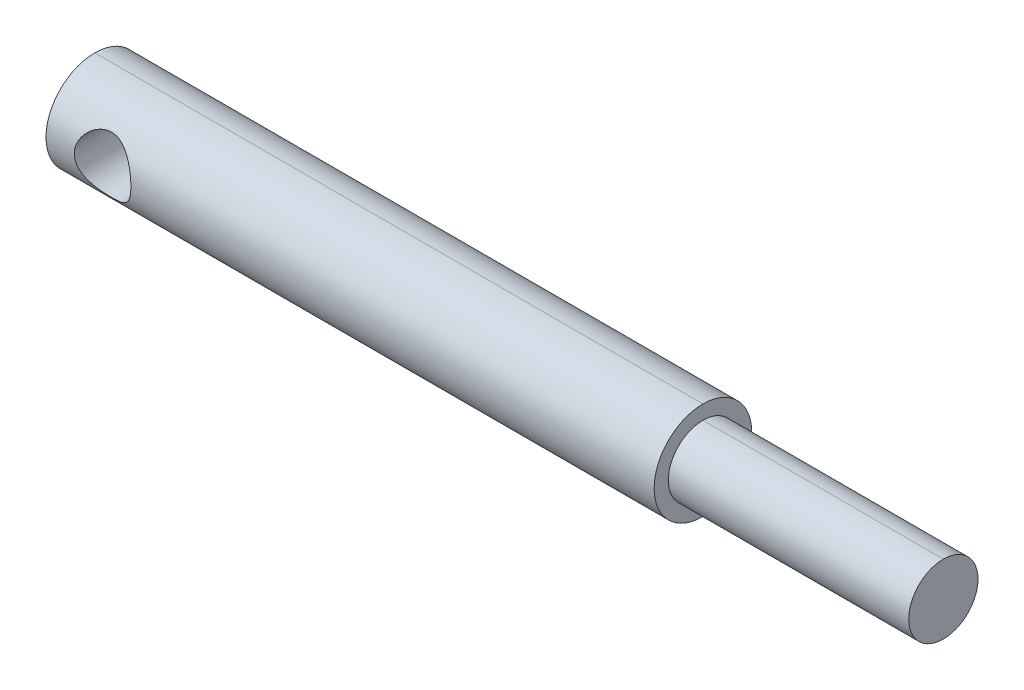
ISO-10303-21;
HEADER;
FILE_DESCRIPTION(('STEP AP214'),'2;1');
FILE_NAME('part.step','',(''),(''),'','','');
FILE_SCHEMA(('AUTOMOTIVE_DESIGN { 1 0 10303 214 1 1 1 1 }'));
ENDSEC;
DATA;
#1=APPLICATION_CONTEXT('core data for automotive mechanical design processes');
#2=APPLICATION_PROTOCOL_DEFINITION('international standard','automotive_design',2000,#1);
#3=PRODUCT_CONTEXT('',#1,'mechanical');
#4=PRODUCT('Part','Part','',(#3));
#5=PRODUCT_RELATED_PRODUCT_CATEGORY('part','',(#4));
#6=PRODUCT_DEFINITION_FORMATION('','',#4);
#7=PRODUCT_DEFINITION_CONTEXT('part definition',#1,'design');
#8=PRODUCT_DEFINITION('design','',#6,#7);
#9=PRODUCT_DEFINITION_SHAPE('','',#8);
#10=(LENGTH_UNIT() NAMED_UNIT(*) SI_UNIT(.MILLI.,.METRE.));
#11=(NAMED_UNIT(*) PLANE_ANGLE_UNIT() SI_UNIT($,.RADIAN.));
#12=(NAMED_UNIT(*) SI_UNIT($,.STERADIAN.) SOLID_ANGLE_UNIT());
#13=UNCERTAINTY_MEASURE_WITH_UNIT(LENGTH_MEASURE(1.E-05),#10,'distance_accuracy_value','');
#14=(GEOMETRIC_REPRESENTATION_CONTEXT(3) GLOBAL_UNCERTAINTY_ASSIGNED_CONTEXT((#13)) GLOBAL_UNIT_ASSIGNED_CONTEXT((#10,
#11,#12)) REPRESENTATION_CONTEXT('',''));
#15=CARTESIAN_POINT('',(0.,0.,0.));
#16=DIRECTION('',(0.,0.,1.));
#17=DIRECTION('',(1.,0.,0.));
#18=AXIS2_PLACEMENT_3D('',#15,#16,#17);
#19=CARTESIAN_POINT('',(-246.,48.0172,-6.9828));
#20=DIRECTION('',(1.,0.,0.));
#21=DIRECTION('',(0.,1.,0.));
#22=AXIS2_PLACEMENT_3D('',#19,#20,#21);
#23=PLANE('',#22);
#24=CARTESIAN_POINT('',(-246.,55.,0.));
#25=DIRECTION('',(1.,0.,0.));
#26=DIRECTION('',(0.,0.,-1.));
#27=AXIS2_PLACEMENT_3D('',#24,#25,#26);
#28=CIRCLE('',#27,6.9);
#29=CARTESIAN_POINT('',(-246.,61.9,-6.19576247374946E-10));
#30=VERTEX_POINT('',#29);
#31=CARTESIAN_POINT('',(-246.,48.1,-2.83042710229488E-09));
#32=VERTEX_POINT('',#31);
#33=EDGE_CURVE('E74',#30,#32,#28,.F.);
#34=ORIENTED_EDGE('',*,*,#33,.T.);
#35=CARTESIAN_POINT('',(-246.,55.,0.));
#36=DIRECTION('',(1.,0.,0.));
#37=DIRECTION('',(0.,0.,-1.));
#38=AXIS2_PLACEMENT_3D('',#35,#36,#37);
#39=CIRCLE('',#38,6.9);
#40=EDGE_CURVE('E78',#32,#30,#39,.F.);
#41=ORIENTED_EDGE('',*,*,#40,.T.);
#42=EDGE_LOOP('',(#34,#41));
#43=FACE_BOUND('',#42,.T.);
#44=ADVANCED_FACE('F32',(#43),#23,.F.);
#45=CARTESIAN_POINT('',(-246.,55.,0.));
#46=DIRECTION('',(1.,0.,0.));
#47=DIRECTION('',(0.,0.,-1.));
#48=AXIS2_PLACEMENT_3D('',#45,#46,#47);
#49=CYLINDRICAL_SURFACE('',#48,6.9);
#50=CARTESIAN_POINT('',(-234.,55.,-6.90000000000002));
#51=CARTESIAN_POINT('',(-234.000000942,55.1029536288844,-6.89999914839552));
#52=CARTESIAN_POINT('',(-234.003981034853,55.2059322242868,-6.89768975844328));
#53=CARTESIAN_POINT('',(-234.019851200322,55.4111154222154,-6.88850812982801));
#54=CARTESIAN_POINT('',(-234.031745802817,55.5133195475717,-6.88163327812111));
#55=CARTESIAN_POINT('',(-234.063319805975,55.716319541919,-6.8634744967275));
#56=CARTESIAN_POINT('',(-234.083013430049,55.8171124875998,-6.85218251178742));
#57=CARTESIAN_POINT('',(-234.129928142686,56.0163871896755,-6.82547368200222));
#58=CARTESIAN_POINT('',(-234.157152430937,56.1148679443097,-6.81005508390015));
#59=CARTESIAN_POINT('',(-234.249351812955,56.4048279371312,-6.75830854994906));
#60=CARTESIAN_POINT('',(-234.325045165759,56.5920284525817,-6.71637576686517));
#61=CARTESIAN_POINT('',(-234.502031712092,56.9504528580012,-6.6211962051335));
#62=CARTESIAN_POINT('',(-234.603319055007,57.1216803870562,-6.56795201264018));
#63=CARTESIAN_POINT('',(-234.836966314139,57.4576592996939,-6.45010475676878));
#64=CARTESIAN_POINT('',(-234.971062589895,57.6210102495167,-6.38495451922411));
#65=CARTESIAN_POINT('',(-235.262658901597,57.9242609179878,-6.25189508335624));
#66=CARTESIAN_POINT('',(-235.420186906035,58.0641321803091,-6.18398265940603));
#67=CARTESIAN_POINT('',(-235.775139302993,58.3324040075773,-6.04404159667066));
#68=CARTESIAN_POINT('',(-235.975058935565,58.4577379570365,-5.97241093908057));
#69=CARTESIAN_POINT('',(-236.397316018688,58.6725030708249,-5.84281917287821));
#70=CARTESIAN_POINT('',(-236.619618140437,58.7619897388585,-5.7848369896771));
#71=CARTESIAN_POINT('',(-237.028696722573,58.8847457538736,-5.70288612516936));
#72=CARTESIAN_POINT('',(-237.212076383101,58.9261667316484,-5.67418342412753));
#73=CARTESIAN_POINT('',(-237.584643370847,58.9828228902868,-5.63456907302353));
#74=CARTESIAN_POINT('',(-237.773823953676,58.9980873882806,-5.62363750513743));
#75=CARTESIAN_POINT('',(-238.152849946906,59.0015765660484,-5.62115580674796));
#76=CARTESIAN_POINT('',(-238.342695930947,58.9897600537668,-5.6296352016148));
#77=CARTESIAN_POINT('',(-238.717187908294,58.9397195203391,-5.66475958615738));
#78=CARTESIAN_POINT('',(-238.901830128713,58.901476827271,-5.69141741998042));
#79=CARTESIAN_POINT('',(-239.260211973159,58.800832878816,-5.75910335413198));
#80=CARTESIAN_POINT('',(-239.434012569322,58.7385842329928,-5.80004052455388));
#81=CARTESIAN_POINT('',(-239.769220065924,58.5921251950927,-5.89186690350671));
#82=CARTESIAN_POINT('',(-239.930622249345,58.5079064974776,-5.94275987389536));
#83=CARTESIAN_POINT('',(-240.264658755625,58.3038846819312,-6.05889860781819));
#84=CARTESIAN_POINT('',(-240.434771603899,58.1805066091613,-6.12512813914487));
#85=CARTESIAN_POINT('',(-240.753530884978,57.9089529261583,-6.25867106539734));
#86=CARTESIAN_POINT('',(-240.902158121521,57.7607553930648,-6.32598537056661));
#87=CARTESIAN_POINT('',(-241.191932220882,57.4221660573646,-6.46376529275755));
#88=CARTESIAN_POINT('',(-241.330003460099,57.2288393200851,-6.53362834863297));
#89=CARTESIAN_POINT('',(-241.510782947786,56.9205849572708,-6.62819704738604));
#90=CARTESIAN_POINT('',(-241.566672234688,56.8147427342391,-6.65802567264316));
#91=CARTESIAN_POINT('',(-241.669076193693,56.5975797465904,-6.71343854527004));
#92=CARTESIAN_POINT('',(-241.71559658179,56.4862623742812,-6.73902537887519));
#93=CARTESIAN_POINT('',(-241.795848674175,56.2666007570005,-6.78361504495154));
#94=CARTESIAN_POINT('',(-241.830229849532,56.1585596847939,-6.80294484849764));
#95=CARTESIAN_POINT('',(-241.889814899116,55.9392746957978,-6.83666991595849));
#96=CARTESIAN_POINT('',(-241.915023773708,55.8280325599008,-6.85106786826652));
#97=CARTESIAN_POINT('',(-241.955886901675,55.6033182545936,-6.87450078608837));
#98=CARTESIAN_POINT('',(-241.97154702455,55.4898474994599,-6.883539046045));
#99=CARTESIAN_POINT('',(-241.993075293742,55.2616785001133,-6.89598230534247));
#100=CARTESIAN_POINT('',(-241.998944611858,55.146980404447,-6.89938797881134));
#101=CARTESIAN_POINT('',(-242.000679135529,54.9319303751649,-6.90039387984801));
#102=CARTESIAN_POINT('',(-241.997709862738,54.831588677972,-6.89867047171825));
#103=CARTESIAN_POINT('',(-241.984255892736,54.6315475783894,-6.890882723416));
#104=CARTESIAN_POINT('',(-241.973768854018,54.5318483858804,-6.88481703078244));
#105=CARTESIAN_POINT('',(-241.945414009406,54.3338929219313,-6.86849010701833));
#106=CARTESIAN_POINT('',(-241.927549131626,54.2356360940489,-6.85823054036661));
#107=CARTESIAN_POINT('',(-241.884662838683,54.041185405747,-6.83376185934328));
#108=CARTESIAN_POINT('',(-241.859638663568,53.9449923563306,-6.81955122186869));
#109=CARTESIAN_POINT('',(-241.775046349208,53.6632000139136,-6.77191120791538));
#110=CARTESIAN_POINT('',(-241.705513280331,53.4813671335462,-6.73320893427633));
#111=CARTESIAN_POINT('',(-241.542283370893,53.1319761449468,-6.64477881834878));
#112=CARTESIAN_POINT('',(-241.448581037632,52.9644212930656,-6.59504847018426));
#113=CARTESIAN_POINT('',(-241.228669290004,52.6293650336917,-6.48262639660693));
#114=CARTESIAN_POINT('',(-241.100088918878,52.4636914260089,-6.41912382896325));
#115=CARTESIAN_POINT('',(-240.819495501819,52.1549964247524,-6.28841250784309));
#116=CARTESIAN_POINT('',(-240.667455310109,52.0120016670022,-6.22119951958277));
#117=CARTESIAN_POINT('',(-240.323346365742,51.7355990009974,-6.08114935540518));
#118=CARTESIAN_POINT('',(-240.128675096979,51.6052746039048,-6.00857525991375));
#119=CARTESIAN_POINT('',(-239.716470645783,51.3793954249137,-5.8752433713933));
#120=CARTESIAN_POINT('',(-239.498966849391,51.2837966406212,-5.81447067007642));
#121=CARTESIAN_POINT('',(-239.094694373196,51.1481415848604,-5.72523500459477));
#122=CARTESIAN_POINT('',(-238.911369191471,51.1005633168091,-5.69263491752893));
#123=CARTESIAN_POINT('',(-238.537703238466,51.0317693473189,-5.64490496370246));
#124=CARTESIAN_POINT('',(-238.347371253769,51.0105217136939,-5.62975393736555));
#125=CARTESIAN_POINT('',(-237.964584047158,50.9955628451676,-5.61912671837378));
#126=CARTESIAN_POINT('',(-237.772124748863,51.0019195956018,-5.62369910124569));
#127=CARTESIAN_POINT('',(-237.391455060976,51.0419254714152,-5.65192055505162));
#128=CARTESIAN_POINT('',(-237.203247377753,51.0755915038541,-5.6755814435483));
#129=CARTESIAN_POINT('',(-236.84082651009,51.1671941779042,-5.73781556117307));
#130=CARTESIAN_POINT('',(-236.666378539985,51.224488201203,-5.77599200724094));
#131=CARTESIAN_POINT('',(-236.329229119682,51.3610916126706,-5.86301024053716));
#132=CARTESIAN_POINT('',(-236.166531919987,51.4404089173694,-5.91185586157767));
#133=CARTESIAN_POINT('',(-235.830631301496,51.63297076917,-6.02389611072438));
#134=CARTESIAN_POINT('',(-235.65969853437,51.7495661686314,-6.08814150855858));
#135=CARTESIAN_POINT('',(-235.33816570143,52.0071464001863,-6.218822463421));
#136=CARTESIAN_POINT('',(-235.18758437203,52.1481534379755,-6.28525996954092));
#137=CARTESIAN_POINT('',(-234.890171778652,52.4733916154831,-6.42350426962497));
#138=CARTESIAN_POINT('',(-234.746617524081,52.6608911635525,-6.49481761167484));
#139=CARTESIAN_POINT('',(-234.556738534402,52.9608818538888,-6.59265829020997));
#140=CARTESIAN_POINT('',(-234.497672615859,53.0640387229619,-6.62375887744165));
#141=CARTESIAN_POINT('',(-234.38858056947,53.2760970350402,-6.68208171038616));
#142=CARTESIAN_POINT('',(-234.338551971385,53.3849968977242,-6.70930501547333));
#143=CARTESIAN_POINT('',(-234.256251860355,53.5878713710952,-6.75460538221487));
#144=CARTESIAN_POINT('',(-234.222404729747,53.6810407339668,-6.7734476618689));
#145=CARTESIAN_POINT('',(-234.161578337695,53.8702277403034,-6.80755796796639));
#146=CARTESIAN_POINT('',(-234.134597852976,53.9662448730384,-6.82282663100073));
#147=CARTESIAN_POINT('',(-234.08785660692,54.1603129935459,-6.84941585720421));
#148=CARTESIAN_POINT('',(-234.068078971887,54.2583586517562,-6.86074564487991));
#149=CARTESIAN_POINT('',(-234.035900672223,54.45600432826,-6.8792375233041));
#150=CARTESIAN_POINT('',(-234.023496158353,54.5556035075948,-6.8864017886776));
#151=CARTESIAN_POINT('',(-234.009908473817,54.7128235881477,-6.89425964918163));
#152=CARTESIAN_POINT('',(-234.006194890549,54.7701672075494,-6.89641030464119));
#153=CARTESIAN_POINT('',(-234.001240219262,54.885004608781,-6.8992808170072));
#154=CARTESIAN_POINT('',(-233.999999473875,54.942498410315,-6.90000047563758));
#155=CARTESIAN_POINT('',(-234.,55.,-6.90000000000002));
#156=B_SPLINE_CURVE_WITH_KNOTS('',3,(#50,#51,#52,#53,#54,#55,#56,#57,#58,#59,#60,#61,#62,#63,
#64,#65,#66,#67,#68,#69,#70,#71,#72,#73,#74,#75,#76,#77,#78,#79,#80,#81,#82,#83,#84,#85,#86,#87,
#88,#89,#90,#91,#92,#93,#94,#95,#96,#97,#98,#99,#100,#101,#102,#103,#104,#105,#106,#107,#108,
#109,#110,#111,#112,#113,#114,#115,#116,#117,#118,#119,#120,#121,#122,#123,#124,#125,#126,#127,
#128,#129,#130,#131,#132,#133,#134,#135,#136,#137,#138,#139,#140,#141,#142,#143,#144,#145,#146,
#147,#148,#149,#150,#151,#152,#153,#154,#155),.UNSPECIFIED.,.T.,.F.,(4,2,2,2,2,2,2,2,2,2,2,2,2,
2,2,2,2,2,2,2,2,2,2,2,2,2,2,2,2,2,2,2,2,2,2,2,2,2,2,2,2,2,2,2,2,2,2,2,2,2,2,2,4),(0.,
0.308801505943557,0.617779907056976,0.927324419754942,1.23700065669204,1.85272790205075,
2.4683145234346,3.12913553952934,3.79075174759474,4.52689089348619,5.26188580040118,
5.82996811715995,6.39741328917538,6.96572215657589,7.53443298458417,8.09958649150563,
8.66495395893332,9.32334568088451,9.98232205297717,10.7209503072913,11.0905649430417,
11.4599533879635,11.804510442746,12.1488793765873,12.4930364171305,12.83715226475,
13.1379827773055,13.4389070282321,13.7397119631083,14.0406330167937,14.633393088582,
15.2262879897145,15.8810130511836,16.5365014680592,17.2687489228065,18.000065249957,
18.5741784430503,19.1475947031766,19.7224239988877,20.2976094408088,20.8580872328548,
21.4187667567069,22.0662154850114,22.7142562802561,23.450167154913,23.8183609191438,
24.1864538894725,24.488848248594,24.7911886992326,25.0928162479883,25.3942861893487,
25.5667339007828,25.7392055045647),.UNSPECIFIED.);
#157=CARTESIAN_POINT('',(-234.,55.,-6.90000000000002));
#158=VERTEX_POINT('',#157);
#159=EDGE_CURVE('E81',#158,#158,#156,.T.);
#160=ORIENTED_EDGE('',*,*,#159,.T.);
#161=EDGE_LOOP('',(#160));
#162=FACE_BOUND('',#161,.T.);
#163=ORIENTED_EDGE('',*,*,#33,.F.);
#164=DIRECTION('',(-1.,0.,0.));
#165=VECTOR('',#164,1.);
#166=CARTESIAN_POINT('',(-203.,61.9,0.));
#167=LINE('',#166,#165);
#168=CARTESIAN_POINT('',(-160.,61.9,0.));
#169=VERTEX_POINT('',#168);
#170=EDGE_CURVE('E80',#30,#169,#167,.F.);
#171=ORIENTED_EDGE('',*,*,#170,.T.);
#172=CARTESIAN_POINT('',(-160.,55.,-1.72969529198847E-13));
#173=DIRECTION('',(1.,0.,0.));
#174=DIRECTION('',(0.,0.,-1.));
#175=AXIS2_PLACEMENT_3D('',#172,#173,#174);
#176=CIRCLE('',#175,6.9);
#177=CARTESIAN_POINT('',(-160.,48.1,-2.83042778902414E-09));
#178=VERTEX_POINT('',#177);
#179=EDGE_CURVE('E86',#169,#178,#176,.F.);
#180=ORIENTED_EDGE('',*,*,#179,.T.);
#181=DIRECTION('',(1.,0.,0.));
#182=VECTOR('',#181,1.);
#183=CARTESIAN_POINT('',(-203.,48.1,-2.83042731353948E-09));
#184=LINE('',#183,#182);
#185=EDGE_CURVE('E83',#178,#32,#184,.F.);
#186=ORIENTED_EDGE('',*,*,#185,.T.);
#187=EDGE_LOOP('',(#163,#171,#180,#186));
#188=FACE_BOUND('',#187,.T.);
#189=ADVANCED_FACE('F84',(#162,#188),#49,.T.);
#190=CARTESIAN_POINT('',(-246.,55.,0.));
#191=DIRECTION('',(1.,0.,0.));
#192=DIRECTION('',(0.,0.,-1.));
#193=AXIS2_PLACEMENT_3D('',#190,#191,#192);
#194=CYLINDRICAL_SURFACE('',#193,6.9);
#195=CARTESIAN_POINT('',(-234.,55.,6.89999999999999));
#196=CARTESIAN_POINT('',(-234.000000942,54.8970463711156,6.89999914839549));
#197=CARTESIAN_POINT('',(-234.003981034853,54.7940677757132,6.89768975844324));
#198=CARTESIAN_POINT('',(-234.019851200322,54.5888845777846,6.88850812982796));
#199=CARTESIAN_POINT('',(-234.031745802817,54.4866804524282,6.88163327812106));
#200=CARTESIAN_POINT('',(-234.063319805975,54.283680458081,6.86347449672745));
#201=CARTESIAN_POINT('',(-234.083013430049,54.1828875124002,6.85218251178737));
#202=CARTESIAN_POINT('',(-234.129928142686,53.9836128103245,6.82547368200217));
#203=CARTESIAN_POINT('',(-234.157152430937,53.8851320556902,6.8100550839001));
#204=CARTESIAN_POINT('',(-234.249351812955,53.5951720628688,6.75830854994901));
#205=CARTESIAN_POINT('',(-234.325045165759,53.4079715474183,6.71637576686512));
#206=CARTESIAN_POINT('',(-234.502031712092,53.0495471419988,6.62119620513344));
#207=CARTESIAN_POINT('',(-234.603319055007,52.8783196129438,6.56795201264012));
#208=CARTESIAN_POINT('',(-234.836966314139,52.5423407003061,6.45010475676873));
#209=CARTESIAN_POINT('',(-234.971062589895,52.3789897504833,6.38495451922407));
#210=CARTESIAN_POINT('',(-235.262658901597,52.0757390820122,6.2518950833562));
#211=CARTESIAN_POINT('',(-235.420186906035,51.9358678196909,6.18398265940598));
#212=CARTESIAN_POINT('',(-235.775139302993,51.6675959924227,6.04404159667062));
#213=CARTESIAN_POINT('',(-235.975058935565,51.5422620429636,5.97241093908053));
#214=CARTESIAN_POINT('',(-236.397316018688,51.3274969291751,5.84281917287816));
#215=CARTESIAN_POINT('',(-236.619618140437,51.2380102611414,5.78483698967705));
#216=CARTESIAN_POINT('',(-237.028696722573,51.1152542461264,5.7028861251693));
#217=CARTESIAN_POINT('',(-237.212076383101,51.0738332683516,5.67418342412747));
#218=CARTESIAN_POINT('',(-237.584643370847,51.0171771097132,5.63456907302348));
#219=CARTESIAN_POINT('',(-237.773823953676,51.0019126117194,5.62363750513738));
#220=CARTESIAN_POINT('',(-238.152849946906,50.9984234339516,5.6211558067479));
#221=CARTESIAN_POINT('',(-238.342695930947,51.0102399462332,5.62963520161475));
#222=CARTESIAN_POINT('',(-238.717187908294,51.0602804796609,5.66475958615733));
#223=CARTESIAN_POINT('',(-238.901830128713,51.098523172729,5.69141741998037));
#224=CARTESIAN_POINT('',(-239.260211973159,51.199167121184,5.75910335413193));
#225=CARTESIAN_POINT('',(-239.434012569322,51.2614157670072,5.80004052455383));
#226=CARTESIAN_POINT('',(-239.769220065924,51.4078748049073,5.89186690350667));
#227=CARTESIAN_POINT('',(-239.930622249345,51.4920935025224,5.94275987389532));
#228=CARTESIAN_POINT('',(-240.264658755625,51.6961153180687,6.05889860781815));
#229=CARTESIAN_POINT('',(-240.434771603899,51.8194933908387,6.12512813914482));
#230=CARTESIAN_POINT('',(-240.753530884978,52.0910470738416,6.2586710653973));
#231=CARTESIAN_POINT('',(-240.902158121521,52.2392446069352,6.32598537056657));
#232=CARTESIAN_POINT('',(-241.191932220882,52.5778339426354,6.46376529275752));
#233=CARTESIAN_POINT('',(-241.330003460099,52.7711606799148,6.53362834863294));
#234=CARTESIAN_POINT('',(-241.510782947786,53.0794150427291,6.62819704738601));
#235=CARTESIAN_POINT('',(-241.566672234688,53.1852572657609,6.65802567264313));
#236=CARTESIAN_POINT('',(-241.669076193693,53.4024202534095,6.71343854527));
#237=CARTESIAN_POINT('',(-241.71559658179,53.5137376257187,6.73902537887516));
#238=CARTESIAN_POINT('',(-241.795848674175,53.7333992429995,6.78361504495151));
#239=CARTESIAN_POINT('',(-241.830229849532,53.8414403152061,6.80294484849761));
#240=CARTESIAN_POINT('',(-241.889814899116,54.0607253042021,6.83666991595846));
#241=CARTESIAN_POINT('',(-241.915023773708,54.1719674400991,6.8510678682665));
#242=CARTESIAN_POINT('',(-241.955886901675,54.3966817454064,6.87450078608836));
#243=CARTESIAN_POINT('',(-241.97154702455,54.5101525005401,6.88353904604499));
#244=CARTESIAN_POINT('',(-241.993075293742,54.7383214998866,6.89598230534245));
#245=CARTESIAN_POINT('',(-241.998944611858,54.8530195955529,6.89938797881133));
#246=CARTESIAN_POINT('',(-242.000679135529,55.068069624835,6.900393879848));
#247=CARTESIAN_POINT('',(-241.997709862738,55.168411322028,6.89867047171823));
#248=CARTESIAN_POINT('',(-241.984255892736,55.3684524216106,6.89088272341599));
#249=CARTESIAN_POINT('',(-241.973768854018,55.4681516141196,6.88481703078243));
#250=CARTESIAN_POINT('',(-241.945414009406,55.6661070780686,6.86849010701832));
#251=CARTESIAN_POINT('',(-241.927549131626,55.7643639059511,6.85823054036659));
#252=CARTESIAN_POINT('',(-241.884662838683,55.9588145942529,6.83376185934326));
#253=CARTESIAN_POINT('',(-241.859638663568,56.0550076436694,6.81955122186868));
#254=CARTESIAN_POINT('',(-241.775046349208,56.3367999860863,6.77191120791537));
#255=CARTESIAN_POINT('',(-241.705513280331,56.5186328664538,6.73320893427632));
#256=CARTESIAN_POINT('',(-241.542283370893,56.8680238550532,6.64477881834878));
#257=CARTESIAN_POINT('',(-241.448581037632,57.0355787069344,6.59504847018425));
#258=CARTESIAN_POINT('',(-241.228669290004,57.3706349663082,6.48262639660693));
#259=CARTESIAN_POINT('',(-241.100088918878,57.5363085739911,6.41912382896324));
#260=CARTESIAN_POINT('',(-240.819495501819,57.8450035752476,6.28841250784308));
#261=CARTESIAN_POINT('',(-240.667455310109,57.9879983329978,6.22119951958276));
#262=CARTESIAN_POINT('',(-240.323346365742,58.2644009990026,6.08114935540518));
#263=CARTESIAN_POINT('',(-240.128675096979,58.3947253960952,6.00857525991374));
#264=CARTESIAN_POINT('',(-239.716470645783,58.6206045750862,5.87524337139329));
#265=CARTESIAN_POINT('',(-239.498966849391,58.7162033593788,5.81447067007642));
#266=CARTESIAN_POINT('',(-239.094694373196,58.8518584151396,5.72523500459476));
#267=CARTESIAN_POINT('',(-238.911369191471,58.8994366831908,5.69263491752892));
#268=CARTESIAN_POINT('',(-238.537703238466,58.9682306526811,5.64490496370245));
#269=CARTESIAN_POINT('',(-238.347371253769,58.9894782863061,5.62975393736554));
#270=CARTESIAN_POINT('',(-237.964584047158,59.0044371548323,5.61912671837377));
#271=CARTESIAN_POINT('',(-237.772124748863,58.9980804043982,5.62369910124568));
#272=CARTESIAN_POINT('',(-237.391455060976,58.9580745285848,5.6519205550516));
#273=CARTESIAN_POINT('',(-237.203247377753,58.9244084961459,5.67558144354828));
#274=CARTESIAN_POINT('',(-236.84082651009,58.8328058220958,5.73781556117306));
#275=CARTESIAN_POINT('',(-236.666378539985,58.775511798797,5.77599200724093));
#276=CARTESIAN_POINT('',(-236.329229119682,58.6389083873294,5.86301024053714));
#277=CARTESIAN_POINT('',(-236.166531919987,58.5595910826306,5.91185586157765));
#278=CARTESIAN_POINT('',(-235.830631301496,58.36702923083,6.02389611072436));
#279=CARTESIAN_POINT('',(-235.65969853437,58.2504338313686,6.08814150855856));
#280=CARTESIAN_POINT('',(-235.33816570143,57.9928535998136,6.21882246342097));
#281=CARTESIAN_POINT('',(-235.18758437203,57.8518465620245,6.2852599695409));
#282=CARTESIAN_POINT('',(-234.890171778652,57.5266083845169,6.42350426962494));
#283=CARTESIAN_POINT('',(-234.746617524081,57.3391088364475,6.49481761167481));
#284=CARTESIAN_POINT('',(-234.556738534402,57.0391181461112,6.59265829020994));
#285=CARTESIAN_POINT('',(-234.497672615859,56.935961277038,6.62375887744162));
#286=CARTESIAN_POINT('',(-234.38858056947,56.7239029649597,6.68208171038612));
#287=CARTESIAN_POINT('',(-234.338551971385,56.6150031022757,6.70930501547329));
#288=CARTESIAN_POINT('',(-234.256251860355,56.4121286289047,6.75460538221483));
#289=CARTESIAN_POINT('',(-234.222404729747,56.3189592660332,6.77344766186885));
#290=CARTESIAN_POINT('',(-234.161578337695,56.1297722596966,6.80755796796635));
#291=CARTESIAN_POINT('',(-234.134597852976,56.0337551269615,6.82282663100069));
#292=CARTESIAN_POINT('',(-234.08785660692,55.839687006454,6.84941585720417));
#293=CARTESIAN_POINT('',(-234.068078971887,55.7416413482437,6.86074564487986));
#294=CARTESIAN_POINT('',(-234.035900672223,55.54399567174,6.87923752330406));
#295=CARTESIAN_POINT('',(-234.023496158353,55.4443964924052,6.88640178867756));
#296=CARTESIAN_POINT('',(-234.009908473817,55.2871764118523,6.89425964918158));
#297=CARTESIAN_POINT('',(-234.006194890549,55.2298327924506,6.89641030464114));
#298=CARTESIAN_POINT('',(-234.001240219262,55.114995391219,6.89928081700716));
#299=CARTESIAN_POINT('',(-233.999999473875,55.057501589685,6.90000047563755));
#300=CARTESIAN_POINT('',(-234.,55.,6.89999999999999));
#301=B_SPLINE_CURVE_WITH_KNOTS('',3,(#195,#196,#197,#198,#199,#200,#201,#202,#203,#204,#205,
#206,#207,#208,#209,#210,#211,#212,#213,#214,#215,#216,#217,#218,#219,#220,#221,#222,#223,#224,
#225,#226,#227,#228,#229,#230,#231,#232,#233,#234,#235,#236,#237,#238,#239,#240,#241,#242,#243,
#244,#245,#246,#247,#248,#249,#250,#251,#252,#253,#254,#255,#256,#257,#258,#259,#260,#261,#262,
#263,#264,#265,#266,#267,#268,#269,#270,#271,#272,#273,#274,#275,#276,#277,#278,#279,#280,#281,
#282,#283,#284,#285,#286,#287,#288,#289,#290,#291,#292,#293,#294,#295,#296,#297,#298,#299,#300),
.UNSPECIFIED.,.T.,.F.,(4,2,2,2,2,2,2,2,2,2,2,2,2,2,2,2,2,2,2,2,2,2,2,2,2,2,2,2,2,2,2,2,2,2,2,2,
2,2,2,2,2,2,2,2,2,2,2,2,2,2,2,2,4),(0.,0.308801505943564,0.617779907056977,0.927324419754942,
1.23700065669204,1.85272790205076,2.46831452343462,3.12913553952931,3.79075174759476,
4.52689089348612,5.26188580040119,5.82996811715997,6.3974132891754,6.9657221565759,
7.53443298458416,8.09958649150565,8.66495395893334,9.32334568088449,9.98232205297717,
10.7209503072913,11.0905649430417,11.4599533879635,11.8045104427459,12.1488793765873,
12.4930364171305,12.83715226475,13.1379827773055,13.4389070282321,13.7397119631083,
14.0406330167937,14.633393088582,15.2262879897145,15.8810130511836,16.5365014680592,
17.2687489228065,18.000065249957,18.5741784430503,19.1475947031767,19.7224239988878,
20.2976094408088,20.8580872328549,21.4187667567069,22.0662154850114,22.7142562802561,
23.450167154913,23.8183609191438,24.1864538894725,24.488848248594,24.7911886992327,
25.0928162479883,25.3942861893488,25.5667339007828,25.7392055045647),.UNSPECIFIED.);
#302=CARTESIAN_POINT('',(-234.,55.,6.89999999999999));
#303=VERTEX_POINT('',#302);
#304=EDGE_CURVE('E11',#303,#303,#301,.T.);
#305=ORIENTED_EDGE('',*,*,#304,.T.);
#306=EDGE_LOOP('',(#305));
#307=FACE_BOUND('',#306,.T.);
#308=ORIENTED_EDGE('',*,*,#185,.F.);
#309=CARTESIAN_POINT('',(-160.,55.,-1.72969529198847E-13));
#310=DIRECTION('',(1.,0.,0.));
#311=DIRECTION('',(0.,0.,-1.));
#312=AXIS2_PLACEMENT_3D('',#309,#310,#311);
#313=CIRCLE('',#312,6.9);
#314=EDGE_CURVE('E97',#178,#169,#313,.F.);
#315=ORIENTED_EDGE('',*,*,#314,.T.);
#316=ORIENTED_EDGE('',*,*,#170,.F.);
#317=ORIENTED_EDGE('',*,*,#40,.F.);
#318=EDGE_LOOP('',(#308,#315,#316,#317));
#319=FACE_BOUND('',#318,.T.);
#320=ADVANCED_FACE('F91',(#307,#319),#194,.T.);
#321=CARTESIAN_POINT('',(-126.,59.9588,-4.9588));
#322=DIRECTION('',(-1.,0.,0.));
#323=DIRECTION('',(0.,-1.,0.));
#324=AXIS2_PLACEMENT_3D('',#321,#322,#323);
#325=PLANE('',#324);
#326=CARTESIAN_POINT('',(-126.,55.,0.));
#327=DIRECTION('',(1.,0.,0.));
#328=DIRECTION('',(0.,0.,-1.));
#329=AXIS2_PLACEMENT_3D('',#326,#327,#328);
#330=CIRCLE('',#329,4.9);
#331=CARTESIAN_POINT('',(-126.,50.1,-2.01001372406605E-09));
#332=VERTEX_POINT('',#331);
#333=CARTESIAN_POINT('',(-126.,59.9,-4.39989203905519E-10));
#334=VERTEX_POINT('',#333);
#335=EDGE_CURVE('E92',#332,#334,#330,.T.);
#336=ORIENTED_EDGE('',*,*,#335,.T.);
#337=CARTESIAN_POINT('',(-126.,55.,0.));
#338=DIRECTION('',(1.,0.,0.));
#339=DIRECTION('',(0.,0.,-1.));
#340=AXIS2_PLACEMENT_3D('',#337,#338,#339);
#341=CIRCLE('',#340,4.9);
#342=EDGE_CURVE('E102',#334,#332,#341,.T.);
#343=ORIENTED_EDGE('',*,*,#342,.T.);
#344=EDGE_LOOP('',(#336,#343));
#345=FACE_BOUND('',#344,.T.);
#346=ADVANCED_FACE('F129',(#345),#325,.F.);
#347=CARTESIAN_POINT('',(-160.,55.,0.));
#348=DIRECTION('',(1.,0.,0.));
#349=DIRECTION('',(0.,0.,-1.));
#350=AXIS2_PLACEMENT_3D('',#347,#348,#349);
#351=CYLINDRICAL_SURFACE('',#350,4.9);
#352=CARTESIAN_POINT('',(-160.,55.,0.));
#353=DIRECTION('',(1.,0.,0.));
#354=DIRECTION('',(0.,0.,-1.));
#355=AXIS2_PLACEMENT_3D('',#352,#353,#354);
#356=CIRCLE('',#355,4.9);
#357=CARTESIAN_POINT('',(-160.,50.1,-2.01001344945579E-09));
#358=VERTEX_POINT('',#357);
#359=CARTESIAN_POINT('',(-160.,59.9,-4.39988929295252E-10));
#360=VERTEX_POINT('',#359);
#361=EDGE_CURVE('E99',#358,#360,#356,.T.);
#362=ORIENTED_EDGE('',*,*,#361,.T.);
#363=DIRECTION('',(-1.,0.,0.));
#364=VECTOR('',#363,1.);
#365=CARTESIAN_POINT('',(-143.,59.9,0.));
#366=LINE('',#365,#364);
#367=EDGE_CURVE('E101',#360,#334,#366,.F.);
#368=ORIENTED_EDGE('',*,*,#367,.T.);
#369=ORIENTED_EDGE('',*,*,#335,.F.);
#370=DIRECTION('',(1.,0.,0.));
#371=VECTOR('',#370,1.);
#372=CARTESIAN_POINT('',(-143.,50.1,-2.01001359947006E-09));
#373=LINE('',#372,#371);
#374=EDGE_CURVE('E54',#332,#358,#373,.F.);
#375=ORIENTED_EDGE('',*,*,#374,.T.);
#376=EDGE_LOOP('',(#362,#368,#369,#375));
#377=FACE_BOUND('',#376,.T.);
#378=ADVANCED_FACE('F127',(#377),#351,.T.);
#379=CARTESIAN_POINT('',(-160.,61.9828,-6.9828));
#380=DIRECTION('',(-1.,0.,0.));
#381=DIRECTION('',(0.,-1.,0.));
#382=AXIS2_PLACEMENT_3D('',#379,#380,#381);
#383=PLANE('',#382);
#384=ORIENTED_EDGE('',*,*,#361,.F.);
#385=CARTESIAN_POINT('',(-160.,55.,0.));
#386=DIRECTION('',(1.,0.,0.));
#387=DIRECTION('',(0.,0.,-1.));
#388=AXIS2_PLACEMENT_3D('',#385,#386,#387);
#389=CIRCLE('',#388,4.9);
#390=EDGE_CURVE('E46',#358,#360,#389,.F.);
#391=ORIENTED_EDGE('',*,*,#390,.T.);
#392=EDGE_LOOP('',(#384,#391));
#393=FACE_BOUND('',#392,.T.);
#394=ORIENTED_EDGE('',*,*,#179,.F.);
#395=ORIENTED_EDGE('',*,*,#314,.F.);
#396=EDGE_LOOP('',(#394,#395));
#397=FACE_BOUND('',#396,.T.);
#398=ADVANCED_FACE('F34',(#393,#397),#383,.F.);
#399=CARTESIAN_POINT('',(-160.,55.,0.));
#400=DIRECTION('',(1.,0.,0.));
#401=DIRECTION('',(0.,0.,-1.));
#402=AXIS2_PLACEMENT_3D('',#399,#400,#401);
#403=CYLINDRICAL_SURFACE('',#402,4.9);
#404=ORIENTED_EDGE('',*,*,#374,.F.);
#405=ORIENTED_EDGE('',*,*,#342,.F.);
#406=ORIENTED_EDGE('',*,*,#367,.F.);
#407=ORIENTED_EDGE('',*,*,#390,.F.);
#408=EDGE_LOOP('',(#404,#405,#406,#407));
#409=FACE_BOUND('',#408,.T.);
#410=ADVANCED_FACE('F121',(#409),#403,.T.);
#411=CARTESIAN_POINT('',(-238.,55.,-6.90000000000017));
#412=DIRECTION('',(0.,0.,1.));
#413=DIRECTION('',(1.,0.,0.));
#414=AXIS2_PLACEMENT_3D('',#411,#412,#413);
#415=CYLINDRICAL_SURFACE('',#414,3.99999999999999);
#416=ORIENTED_EDGE('',*,*,#304,.F.);
#417=EDGE_LOOP('',(#416));
#418=FACE_BOUND('',#417,.T.);
#419=ORIENTED_EDGE('',*,*,#159,.F.);
#420=EDGE_LOOP('',(#419));
#421=FACE_BOUND('',#420,.T.);
#422=ADVANCED_FACE('F117',(#418,#421),#415,.F.);
#423=CLOSED_SHELL('',(#44,#189,#320,#346,#378,#398,#410,#422));
#424=MANIFOLD_SOLID_BREP('B2',#423);
#425=ADVANCED_BREP_SHAPE_REPRESENTATION('',(#18,#424),#14);
#426=SHAPE_DEFINITION_REPRESENTATION(#9,#425);
ENDSEC;
END-ISO-10303-21;
